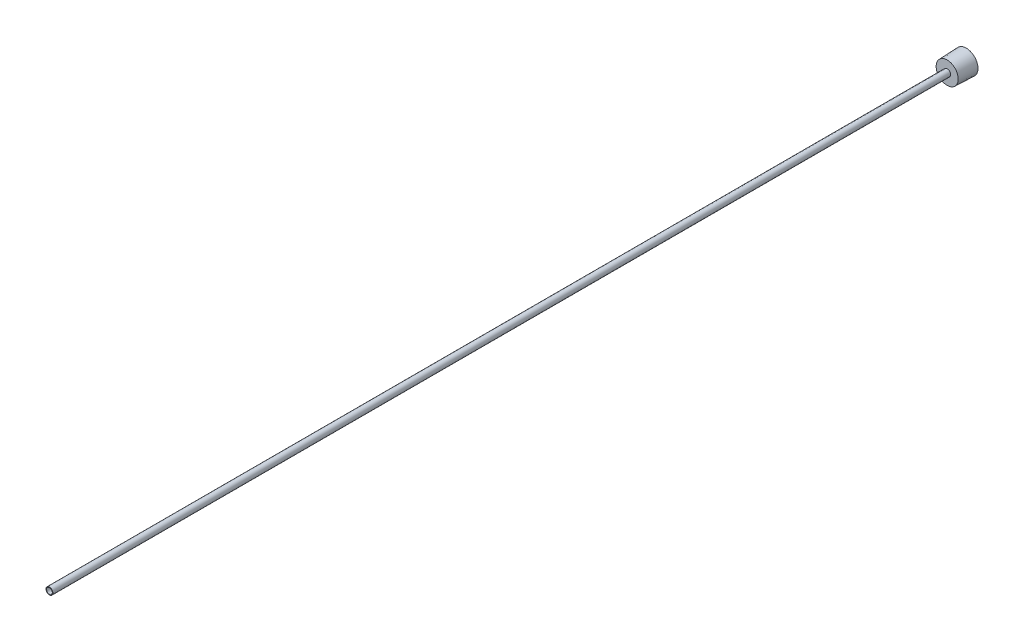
ISO-10303-21;
HEADER;
FILE_DESCRIPTION(('STEP AP214'),'2;1');
FILE_NAME('part.step','',(''),(''),'','','');
FILE_SCHEMA(('AUTOMOTIVE_DESIGN { 1 0 10303 214 1 1 1 1 }'));
ENDSEC;
DATA;
#1=APPLICATION_CONTEXT('core data for automotive mechanical design processes');
#2=APPLICATION_PROTOCOL_DEFINITION('international standard','automotive_design',2000,#1);
#3=PRODUCT_CONTEXT('',#1,'mechanical');
#4=PRODUCT('Part','Part','',(#3));
#5=PRODUCT_RELATED_PRODUCT_CATEGORY('part','',(#4));
#6=PRODUCT_DEFINITION_FORMATION('','',#4);
#7=PRODUCT_DEFINITION_CONTEXT('part definition',#1,'design');
#8=PRODUCT_DEFINITION('design','',#6,#7);
#9=PRODUCT_DEFINITION_SHAPE('','',#8);
#10=(LENGTH_UNIT() NAMED_UNIT(*) SI_UNIT(.MILLI.,.METRE.));
#11=(NAMED_UNIT(*) PLANE_ANGLE_UNIT() SI_UNIT($,.RADIAN.));
#12=(NAMED_UNIT(*) SI_UNIT($,.STERADIAN.) SOLID_ANGLE_UNIT());
#13=UNCERTAINTY_MEASURE_WITH_UNIT(LENGTH_MEASURE(1.E-05),#10,'distance_accuracy_value','');
#14=(GEOMETRIC_REPRESENTATION_CONTEXT(3) GLOBAL_UNCERTAINTY_ASSIGNED_CONTEXT((#13)) GLOBAL_UNIT_ASSIGNED_CONTEXT((#10,
#11,#12)) REPRESENTATION_CONTEXT('',''));
#15=CARTESIAN_POINT('',(0.,0.,0.));
#16=DIRECTION('',(0.,0.,1.));
#17=DIRECTION('',(1.,0.,0.));
#18=AXIS2_PLACEMENT_3D('',#15,#16,#17);
#19=CARTESIAN_POINT('',(0.,0.,0.));
#20=DIRECTION('',(0.,0.,1.));
#21=DIRECTION('',(1.,0.,0.));
#22=AXIS2_PLACEMENT_3D('',#19,#20,#21);
#23=CYLINDRICAL_SURFACE('',#22,0.9652);
#24=CARTESIAN_POINT('',(0.,0.,304.8));
#25=DIRECTION('',(0.,0.,1.));
#26=DIRECTION('',(1.,0.,0.));
#27=AXIS2_PLACEMENT_3D('',#24,#25,#26);
#28=CIRCLE('',#27,0.9652);
#29=CARTESIAN_POINT('',(0.9652,0.,304.8));
#30=VERTEX_POINT('',#29);
#31=EDGE_CURVE('E142',#30,#30,#28,.T.);
#32=CARTESIAN_POINT('',(0.,0.,3.96875));
#33=DIRECTION('',(0.,0.,-1.));
#34=DIRECTION('',(-1.,0.,0.));
#35=AXIS2_PLACEMENT_3D('',#32,#33,#34);
#36=CIRCLE('',#35,0.9652);
#37=CARTESIAN_POINT('',(0.9652,0.,3.96875));
#38=VERTEX_POINT('',#37);
#39=EDGE_CURVE('E37',#38,#38,#36,.F.);
#40=CARTESIAN_POINT('',(0.9652,0.,304.8));
#41=CARTESIAN_POINT('',(0.9652,0.,301.666341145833));
#42=CARTESIAN_POINT('',(0.9652,0.,298.532682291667));
#43=CARTESIAN_POINT('',(0.9652,0.,292.265364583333));
#44=CARTESIAN_POINT('',(0.9652,0.,289.131705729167));
#45=CARTESIAN_POINT('',(0.9652,0.,282.864388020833));
#46=CARTESIAN_POINT('',(0.9652,0.,279.730729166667));
#47=CARTESIAN_POINT('',(0.9652,0.,273.463411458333));
#48=CARTESIAN_POINT('',(0.9652,0.,270.329752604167));
#49=CARTESIAN_POINT('',(0.9652,0.,264.062434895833));
#50=CARTESIAN_POINT('',(0.9652,0.,260.928776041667));
#51=CARTESIAN_POINT('',(0.9652,0.,254.661458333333));
#52=CARTESIAN_POINT('',(0.9652,0.,251.527799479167));
#53=CARTESIAN_POINT('',(0.9652,0.,245.260481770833));
#54=CARTESIAN_POINT('',(0.9652,0.,242.126822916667));
#55=CARTESIAN_POINT('',(0.9652,0.,235.859505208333));
#56=CARTESIAN_POINT('',(0.9652,0.,232.725846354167));
#57=CARTESIAN_POINT('',(0.9652,0.,226.458528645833));
#58=CARTESIAN_POINT('',(0.9652,0.,223.324869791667));
#59=CARTESIAN_POINT('',(0.9652,0.,217.057552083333));
#60=CARTESIAN_POINT('',(0.9652,0.,213.923893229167));
#61=CARTESIAN_POINT('',(0.9652,0.,207.656575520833));
#62=CARTESIAN_POINT('',(0.9652,0.,204.522916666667));
#63=CARTESIAN_POINT('',(0.9652,0.,198.255598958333));
#64=CARTESIAN_POINT('',(0.9652,0.,195.121940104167));
#65=CARTESIAN_POINT('',(0.9652,0.,188.854622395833));
#66=CARTESIAN_POINT('',(0.9652,0.,185.720963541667));
#67=CARTESIAN_POINT('',(0.9652,0.,179.453645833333));
#68=CARTESIAN_POINT('',(0.9652,0.,176.319986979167));
#69=CARTESIAN_POINT('',(0.9652,0.,170.052669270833));
#70=CARTESIAN_POINT('',(0.9652,0.,166.919010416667));
#71=CARTESIAN_POINT('',(0.9652,0.,160.651692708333));
#72=CARTESIAN_POINT('',(0.9652,0.,157.518033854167));
#73=CARTESIAN_POINT('',(0.9652,0.,151.250716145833));
#74=CARTESIAN_POINT('',(0.9652,0.,148.117057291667));
#75=CARTESIAN_POINT('',(0.9652,0.,141.849739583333));
#76=CARTESIAN_POINT('',(0.9652,0.,138.716080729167));
#77=CARTESIAN_POINT('',(0.9652,0.,132.448763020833));
#78=CARTESIAN_POINT('',(0.9652,0.,129.315104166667));
#79=CARTESIAN_POINT('',(0.9652,0.,123.047786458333));
#80=CARTESIAN_POINT('',(0.9652,0.,119.914127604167));
#81=CARTESIAN_POINT('',(0.9652,0.,113.646809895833));
#82=CARTESIAN_POINT('',(0.9652,0.,110.513151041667));
#83=CARTESIAN_POINT('',(0.9652,0.,104.245833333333));
#84=CARTESIAN_POINT('',(0.9652,0.,101.112174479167));
#85=CARTESIAN_POINT('',(0.9652,0.,94.8448567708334));
#86=CARTESIAN_POINT('',(0.9652,0.,91.7111979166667));
#87=CARTESIAN_POINT('',(0.9652,0.,85.4438802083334));
#88=CARTESIAN_POINT('',(0.9652,0.,82.3102213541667));
#89=CARTESIAN_POINT('',(0.9652,0.,76.0429036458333));
#90=CARTESIAN_POINT('',(0.9652,0.,72.9092447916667));
#91=CARTESIAN_POINT('',(0.9652,0.,66.6419270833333));
#92=CARTESIAN_POINT('',(0.9652,0.,63.5082682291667));
#93=CARTESIAN_POINT('',(0.9652,0.,57.2409505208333));
#94=CARTESIAN_POINT('',(0.9652,0.,54.1072916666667));
#95=CARTESIAN_POINT('',(0.9652,0.,47.8399739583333));
#96=CARTESIAN_POINT('',(0.9652,0.,44.7063151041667));
#97=CARTESIAN_POINT('',(0.9652,0.,38.4389973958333));
#98=CARTESIAN_POINT('',(0.9652,0.,35.3053385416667));
#99=CARTESIAN_POINT('',(0.9652,0.,29.0380208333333));
#100=CARTESIAN_POINT('',(0.9652,0.,25.9043619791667));
#101=CARTESIAN_POINT('',(0.9652,0.,19.6370442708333));
#102=CARTESIAN_POINT('',(0.9652,0.,16.5033854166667));
#103=CARTESIAN_POINT('',(0.9652,0.,10.2360677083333));
#104=CARTESIAN_POINT('',(0.9652,0.,7.10240885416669));
#105=CARTESIAN_POINT('',(0.9652,0.,3.96875000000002));
#106=B_SPLINE_CURVE_WITH_KNOTS('',3,(#40,#41,#42,#43,#44,#45,#46,#47,#48,#49,#50,#51,#52,#53,
#54,#55,#56,#57,#58,#59,#60,#61,#62,#63,#64,#65,#66,#67,#68,#69,#70,#71,#72,#73,#74,#75,#76,#77,
#78,#79,#80,#81,#82,#83,#84,#85,#86,#87,#88,#89,#90,#91,#92,#93,#94,#95,#96,#97,#98,#99,#100,
#101,#102,#103,#104,#105),.UNSPECIFIED.,.F.,.F.,(4,2,2,2,2,2,2,2,2,2,2,2,2,2,2,2,2,2,2,2,2,2,2,
2,2,2,2,2,2,2,2,2,4),(0.,9.4009765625,18.801953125,28.2029296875,37.60390625,47.0048828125,
56.405859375,65.8068359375,75.2078125,84.6087890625,94.009765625,103.4107421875,112.81171875,
122.2126953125,131.613671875,141.0146484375,150.415625,159.8166015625,169.217578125,
178.6185546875,188.01953125,197.4205078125,206.821484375,216.2224609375,225.6234375,
235.0244140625,244.425390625,253.8263671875,263.22734375,272.6283203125,282.029296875,
291.4302734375,300.83125),.UNSPECIFIED.);
#107=EDGE_CURVE('BSEAM33',#30,#38,#106,.T.);
#108=ORIENTED_EDGE('',*,*,#31,.T.);
#109=ORIENTED_EDGE('',*,*,#39,.F.);
#110=ORIENTED_EDGE('',*,*,#107,.T.);
#111=ORIENTED_EDGE('',*,*,#107,.F.);
#112=EDGE_LOOP('',(#108,#110,#109,#111));
#113=FACE_BOUND('',#112,.T.);
#114=ADVANCED_FACE('F33',(#113),#23,.F.);
#115=CARTESIAN_POINT('',(0.,0.,0.));
#116=DIRECTION('',(0.,0.,1.));
#117=DIRECTION('',(1.,0.,0.));
#118=AXIS2_PLACEMENT_3D('',#115,#116,#117);
#119=PLANE('',#118);
#120=DIRECTION('',(-0.866025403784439,0.5,0.));
#121=VECTOR('',#120,1.);
#122=CARTESIAN_POINT('',(0.,-2.74963065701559,0.));
#123=LINE('',#122,#121);
#124=CARTESIAN_POINT('',(0.,-2.74963065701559,0.));
#125=VERTEX_POINT('',#124);
#126=CARTESIAN_POINT('',(-2.38125,-1.3748153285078,0.));
#127=VERTEX_POINT('',#126);
#128=EDGE_CURVE('E124',#125,#127,#123,.T.);
#129=ORIENTED_EDGE('',*,*,#128,.F.);
#130=DIRECTION('',(-0.866025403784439,-0.5,0.));
#131=VECTOR('',#130,1.);
#132=CARTESIAN_POINT('',(2.38125,-1.3748153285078,0.));
#133=LINE('',#132,#131);
#134=CARTESIAN_POINT('',(2.38125,-1.3748153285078,0.));
#135=VERTEX_POINT('',#134);
#136=EDGE_CURVE('E49',#135,#125,#133,.T.);
#137=ORIENTED_EDGE('',*,*,#136,.F.);
#138=DIRECTION('',(0.,-1.,0.));
#139=VECTOR('',#138,1.);
#140=CARTESIAN_POINT('',(2.38125,1.3748153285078,0.));
#141=LINE('',#140,#139);
#142=CARTESIAN_POINT('',(2.38125,1.3748153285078,0.));
#143=VERTEX_POINT('',#142);
#144=EDGE_CURVE('E133',#143,#135,#141,.T.);
#145=ORIENTED_EDGE('',*,*,#144,.F.);
#146=DIRECTION('',(0.866025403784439,-0.5,0.));
#147=VECTOR('',#146,1.);
#148=CARTESIAN_POINT('',(0.,2.74963065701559,0.));
#149=LINE('',#148,#147);
#150=CARTESIAN_POINT('',(0.,2.74963065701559,0.));
#151=VERTEX_POINT('',#150);
#152=EDGE_CURVE('E131',#151,#143,#149,.T.);
#153=ORIENTED_EDGE('',*,*,#152,.F.);
#154=DIRECTION('',(0.866025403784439,0.5,0.));
#155=VECTOR('',#154,1.);
#156=CARTESIAN_POINT('',(-2.38125,1.3748153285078,0.));
#157=LINE('',#156,#155);
#158=CARTESIAN_POINT('',(-2.38125,1.3748153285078,0.));
#159=VERTEX_POINT('',#158);
#160=EDGE_CURVE('E97',#159,#151,#157,.T.);
#161=ORIENTED_EDGE('',*,*,#160,.F.);
#162=DIRECTION('',(0.,1.,0.));
#163=VECTOR('',#162,1.);
#164=CARTESIAN_POINT('',(-2.38125,-1.3748153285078,0.));
#165=LINE('',#164,#163);
#166=EDGE_CURVE('E127',#127,#159,#165,.T.);
#167=ORIENTED_EDGE('',*,*,#166,.F.);
#168=EDGE_LOOP('',(#129,#137,#145,#153,#161,#167));
#169=FACE_BOUND('',#168,.T.);
#170=CARTESIAN_POINT('',(0.,0.,0.));
#171=DIRECTION('',(0.,0.,1.));
#172=DIRECTION('',(1.,0.,0.));
#173=AXIS2_PLACEMENT_3D('',#170,#171,#172);
#174=CIRCLE('',#173,3.8989);
#175=CARTESIAN_POINT('',(3.8989,0.,0.));
#176=VERTEX_POINT('',#175);
#177=EDGE_CURVE('E11',#176,#176,#174,.T.);
#178=ORIENTED_EDGE('',*,*,#177,.F.);
#179=EDGE_LOOP('',(#178));
#180=FACE_BOUND('',#179,.T.);
#181=ADVANCED_FACE('F35',(#169,#180),#119,.F.);
#182=CARTESIAN_POINT('',(0.,0.,0.));
#183=DIRECTION('',(0.,0.,-1.));
#184=DIRECTION('',(-1.,0.,0.));
#185=AXIS2_PLACEMENT_3D('',#182,#183,#184);
#186=CONICAL_SURFACE('',#185,3.8989,0.0364424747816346);
#187=CARTESIAN_POINT('',(0.,0.,6.35));
#188=DIRECTION('',(0.,0.,1.));
#189=DIRECTION('',(1.,0.,0.));
#190=AXIS2_PLACEMENT_3D('',#187,#188,#189);
#191=CIRCLE('',#190,3.66738778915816);
#192=CARTESIAN_POINT('',(3.66738778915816,0.,6.35));
#193=VERTEX_POINT('',#192);
#194=EDGE_CURVE('E42',#193,#193,#191,.T.);
#195=ORIENTED_EDGE('',*,*,#194,.F.);
#196=EDGE_LOOP('',(#195));
#197=FACE_BOUND('',#196,.T.);
#198=ORIENTED_EDGE('',*,*,#177,.T.);
#199=EDGE_LOOP('',(#198));
#200=FACE_BOUND('',#199,.T.);
#201=ADVANCED_FACE('F156',(#197,#200),#186,.T.);
#202=CARTESIAN_POINT('',(0.,3.66738778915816,6.35));
#203=DIRECTION('',(0.,0.,-1.));
#204=DIRECTION('',(-1.,0.,0.));
#205=AXIS2_PLACEMENT_3D('',#202,#203,#204);
#206=PLANE('',#205);
#207=CARTESIAN_POINT('',(0.,0.,6.35));
#208=DIRECTION('',(0.,0.,1.));
#209=DIRECTION('',(1.,0.,0.));
#210=AXIS2_PLACEMENT_3D('',#207,#208,#209);
#211=CIRCLE('',#210,1.143);
#212=CARTESIAN_POINT('',(1.143,0.,6.35));
#213=VERTEX_POINT('',#212);
#214=EDGE_CURVE('E148',#213,#213,#211,.T.);
#215=ORIENTED_EDGE('',*,*,#214,.F.);
#216=EDGE_LOOP('',(#215));
#217=FACE_BOUND('',#216,.T.);
#218=ORIENTED_EDGE('',*,*,#194,.T.);
#219=EDGE_LOOP('',(#218));
#220=FACE_BOUND('',#219,.T.);
#221=ADVANCED_FACE('F154',(#217,#220),#206,.F.);
#222=CARTESIAN_POINT('',(0.,0.,0.));
#223=DIRECTION('',(0.,0.,1.));
#224=DIRECTION('',(1.,0.,0.));
#225=AXIS2_PLACEMENT_3D('',#222,#223,#224);
#226=CYLINDRICAL_SURFACE('',#225,1.14299999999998);
#227=CARTESIAN_POINT('',(0.,0.,304.8));
#228=DIRECTION('',(0.,0.,1.));
#229=DIRECTION('',(1.,0.,0.));
#230=AXIS2_PLACEMENT_3D('',#227,#228,#229);
#231=CIRCLE('',#230,1.14299999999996);
#232=CARTESIAN_POINT('',(1.14299999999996,0.,304.8));
#233=VERTEX_POINT('',#232);
#234=EDGE_CURVE('E145',#233,#233,#231,.T.);
#235=ORIENTED_EDGE('',*,*,#234,.F.);
#236=EDGE_LOOP('',(#235));
#237=FACE_BOUND('',#236,.T.);
#238=ORIENTED_EDGE('',*,*,#214,.T.);
#239=EDGE_LOOP('',(#238));
#240=FACE_BOUND('',#239,.T.);
#241=ADVANCED_FACE('F190',(#237,#240),#226,.T.);
#242=CARTESIAN_POINT('',(0.,1.14299999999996,304.8));
#243=DIRECTION('',(0.,0.,-1.));
#244=DIRECTION('',(-1.,0.,0.));
#245=AXIS2_PLACEMENT_3D('',#242,#243,#244);
#246=PLANE('',#245);
#247=ORIENTED_EDGE('',*,*,#31,.F.);
#248=EDGE_LOOP('',(#247));
#249=FACE_BOUND('',#248,.T.);
#250=ORIENTED_EDGE('',*,*,#234,.T.);
#251=EDGE_LOOP('',(#250));
#252=FACE_BOUND('',#251,.T.);
#253=ADVANCED_FACE('F183',(#249,#252),#246,.F.);
#254=CARTESIAN_POINT('',(0.,-2.74963065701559,3.96875));
#255=DIRECTION('',(0.,0.,-1.));
#256=DIRECTION('',(-1.,0.,0.));
#257=AXIS2_PLACEMENT_3D('',#254,#255,#256);
#258=PLANE('',#257);
#259=DIRECTION('',(-0.866025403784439,-0.5,0.));
#260=VECTOR('',#259,1.);
#261=CARTESIAN_POINT('',(2.38125,-1.3748153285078,3.96875));
#262=LINE('',#261,#260);
#263=CARTESIAN_POINT('',(2.38125,-1.3748153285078,3.96875));
#264=VERTEX_POINT('',#263);
#265=CARTESIAN_POINT('',(0.,-2.74963065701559,3.96875));
#266=VERTEX_POINT('',#265);
#267=EDGE_CURVE('E135',#264,#266,#262,.T.);
#268=ORIENTED_EDGE('',*,*,#267,.T.);
#269=DIRECTION('',(-0.866025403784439,0.5,0.));
#270=VECTOR('',#269,1.);
#271=CARTESIAN_POINT('',(0.,-2.74963065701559,3.96875));
#272=LINE('',#271,#270);
#273=CARTESIAN_POINT('',(-2.38125,-1.3748153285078,3.96875));
#274=VERTEX_POINT('',#273);
#275=EDGE_CURVE('E118',#266,#274,#272,.T.);
#276=ORIENTED_EDGE('',*,*,#275,.T.);
#277=DIRECTION('',(0.,1.,0.));
#278=VECTOR('',#277,1.);
#279=CARTESIAN_POINT('',(-2.38125,-1.3748153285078,3.96875));
#280=LINE('',#279,#278);
#281=CARTESIAN_POINT('',(-2.38125,1.3748153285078,3.96875));
#282=VERTEX_POINT('',#281);
#283=EDGE_CURVE('E116',#274,#282,#280,.T.);
#284=ORIENTED_EDGE('',*,*,#283,.T.);
#285=DIRECTION('',(0.866025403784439,0.5,0.));
#286=VECTOR('',#285,1.);
#287=CARTESIAN_POINT('',(-2.38125,1.3748153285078,3.96875));
#288=LINE('',#287,#286);
#289=CARTESIAN_POINT('',(0.,2.74963065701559,3.96875));
#290=VERTEX_POINT('',#289);
#291=EDGE_CURVE('E94',#282,#290,#288,.T.);
#292=ORIENTED_EDGE('',*,*,#291,.T.);
#293=DIRECTION('',(0.866025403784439,-0.5,0.));
#294=VECTOR('',#293,1.);
#295=CARTESIAN_POINT('',(0.,2.74963065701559,3.96875));
#296=LINE('',#295,#294);
#297=CARTESIAN_POINT('',(2.38125,1.3748153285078,3.96875));
#298=VERTEX_POINT('',#297);
#299=EDGE_CURVE('E105',#290,#298,#296,.T.);
#300=ORIENTED_EDGE('',*,*,#299,.T.);
#301=DIRECTION('',(0.,-1.,0.));
#302=VECTOR('',#301,1.);
#303=CARTESIAN_POINT('',(2.38125,1.3748153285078,3.96875));
#304=LINE('',#303,#302);
#305=EDGE_CURVE('E109',#298,#264,#304,.T.);
#306=ORIENTED_EDGE('',*,*,#305,.T.);
#307=EDGE_LOOP('',(#268,#276,#284,#292,#300,#306));
#308=FACE_BOUND('',#307,.T.);
#309=ORIENTED_EDGE('',*,*,#39,.T.);
#310=EDGE_LOOP('',(#309));
#311=FACE_BOUND('',#310,.T.);
#312=ADVANCED_FACE('F112',(#308,#311),#258,.T.);
#313=CARTESIAN_POINT('',(2.38125,-1.3748153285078,3.96875));
#314=DIRECTION('',(0.5,-0.866025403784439,0.));
#315=DIRECTION('',(0.866025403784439,0.5,0.));
#316=AXIS2_PLACEMENT_3D('',#313,#314,#315);
#317=PLANE('',#316);
#318=ORIENTED_EDGE('',*,*,#136,.T.);
#319=DIRECTION('',(0.,0.,-1.));
#320=VECTOR('',#319,1.);
#321=CARTESIAN_POINT('',(0.,-2.74963065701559,3.96875));
#322=LINE('',#321,#320);
#323=EDGE_CURVE('E79',#266,#125,#322,.T.);
#324=ORIENTED_EDGE('',*,*,#323,.F.);
#325=ORIENTED_EDGE('',*,*,#267,.F.);
#326=DIRECTION('',(0.,0.,-1.));
#327=VECTOR('',#326,1.);
#328=CARTESIAN_POINT('',(2.38125,-1.3748153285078,3.96875));
#329=LINE('',#328,#327);
#330=EDGE_CURVE('E57',#264,#135,#329,.T.);
#331=ORIENTED_EDGE('',*,*,#330,.T.);
#332=EDGE_LOOP('',(#318,#324,#325,#331));
#333=FACE_BOUND('',#332,.T.);
#334=ADVANCED_FACE('F174',(#333),#317,.F.);
#335=CARTESIAN_POINT('',(2.38125,1.3748153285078,3.96875));
#336=DIRECTION('',(1.,0.,0.));
#337=DIRECTION('',(0.,0.,-1.));
#338=AXIS2_PLACEMENT_3D('',#335,#336,#337);
#339=PLANE('',#338);
#340=ORIENTED_EDGE('',*,*,#144,.T.);
#341=ORIENTED_EDGE('',*,*,#330,.F.);
#342=ORIENTED_EDGE('',*,*,#305,.F.);
#343=DIRECTION('',(0.,0.,-1.));
#344=VECTOR('',#343,1.);
#345=CARTESIAN_POINT('',(2.38125,1.3748153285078,3.96875));
#346=LINE('',#345,#344);
#347=EDGE_CURVE('E101',#298,#143,#346,.T.);
#348=ORIENTED_EDGE('',*,*,#347,.T.);
#349=EDGE_LOOP('',(#340,#341,#342,#348));
#350=FACE_BOUND('',#349,.T.);
#351=ADVANCED_FACE('F176',(#350),#339,.F.);
#352=CARTESIAN_POINT('',(0.,2.74963065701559,3.96875));
#353=DIRECTION('',(0.5,0.866025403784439,0.));
#354=DIRECTION('',(-0.866025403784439,0.5,0.));
#355=AXIS2_PLACEMENT_3D('',#352,#353,#354);
#356=PLANE('',#355);
#357=ORIENTED_EDGE('',*,*,#152,.T.);
#358=ORIENTED_EDGE('',*,*,#347,.F.);
#359=ORIENTED_EDGE('',*,*,#299,.F.);
#360=DIRECTION('',(0.,0.,-1.));
#361=VECTOR('',#360,1.);
#362=CARTESIAN_POINT('',(0.,2.74963065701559,3.96875));
#363=LINE('',#362,#361);
#364=EDGE_CURVE('E90',#290,#151,#363,.T.);
#365=ORIENTED_EDGE('',*,*,#364,.T.);
#366=EDGE_LOOP('',(#357,#358,#359,#365));
#367=FACE_BOUND('',#366,.T.);
#368=ADVANCED_FACE('F106',(#367),#356,.F.);
#369=CARTESIAN_POINT('',(-2.38125,1.3748153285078,3.96875));
#370=DIRECTION('',(-0.5,0.866025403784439,0.));
#371=DIRECTION('',(-0.866025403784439,-0.5,0.));
#372=AXIS2_PLACEMENT_3D('',#369,#370,#371);
#373=PLANE('',#372);
#374=ORIENTED_EDGE('',*,*,#160,.T.);
#375=ORIENTED_EDGE('',*,*,#364,.F.);
#376=ORIENTED_EDGE('',*,*,#291,.F.);
#377=DIRECTION('',(0.,0.,-1.));
#378=VECTOR('',#377,1.);
#379=CARTESIAN_POINT('',(-2.38125,1.3748153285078,3.96875));
#380=LINE('',#379,#378);
#381=EDGE_CURVE('E102',#282,#159,#380,.T.);
#382=ORIENTED_EDGE('',*,*,#381,.T.);
#383=EDGE_LOOP('',(#374,#375,#376,#382));
#384=FACE_BOUND('',#383,.T.);
#385=ADVANCED_FACE('F92',(#384),#373,.F.);
#386=CARTESIAN_POINT('',(-2.38125,-1.3748153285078,3.96875));
#387=DIRECTION('',(-1.,0.,0.));
#388=DIRECTION('',(0.,0.,1.));
#389=AXIS2_PLACEMENT_3D('',#386,#387,#388);
#390=PLANE('',#389);
#391=ORIENTED_EDGE('',*,*,#166,.T.);
#392=ORIENTED_EDGE('',*,*,#381,.F.);
#393=ORIENTED_EDGE('',*,*,#283,.F.);
#394=DIRECTION('',(0.,0.,-1.));
#395=VECTOR('',#394,1.);
#396=CARTESIAN_POINT('',(-2.38125,-1.3748153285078,3.96875));
#397=LINE('',#396,#395);
#398=EDGE_CURVE('E139',#274,#127,#397,.T.);
#399=ORIENTED_EDGE('',*,*,#398,.T.);
#400=EDGE_LOOP('',(#391,#392,#393,#399));
#401=FACE_BOUND('',#400,.T.);
#402=ADVANCED_FACE('F246',(#401),#390,.F.);
#403=CARTESIAN_POINT('',(0.,-2.74963065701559,3.96875));
#404=DIRECTION('',(-0.5,-0.866025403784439,0.));
#405=DIRECTION('',(0.866025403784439,-0.5,0.));
#406=AXIS2_PLACEMENT_3D('',#403,#404,#405);
#407=PLANE('',#406);
#408=ORIENTED_EDGE('',*,*,#128,.T.);
#409=ORIENTED_EDGE('',*,*,#398,.F.);
#410=ORIENTED_EDGE('',*,*,#275,.F.);
#411=ORIENTED_EDGE('',*,*,#323,.T.);
#412=EDGE_LOOP('',(#408,#409,#410,#411));
#413=FACE_BOUND('',#412,.T.);
#414=ADVANCED_FACE('F172',(#413),#407,.F.);
#415=CLOSED_SHELL('',(#114,#181,#201,#221,#241,#253,#312,#334,#351,#368,#385,#402,#414));
#416=MANIFOLD_SOLID_BREP('B2',#415);
#417=ADVANCED_BREP_SHAPE_REPRESENTATION('',(#18,#416),#14);
#418=SHAPE_DEFINITION_REPRESENTATION(#9,#417);
ENDSEC;
END-ISO-10303-21;
